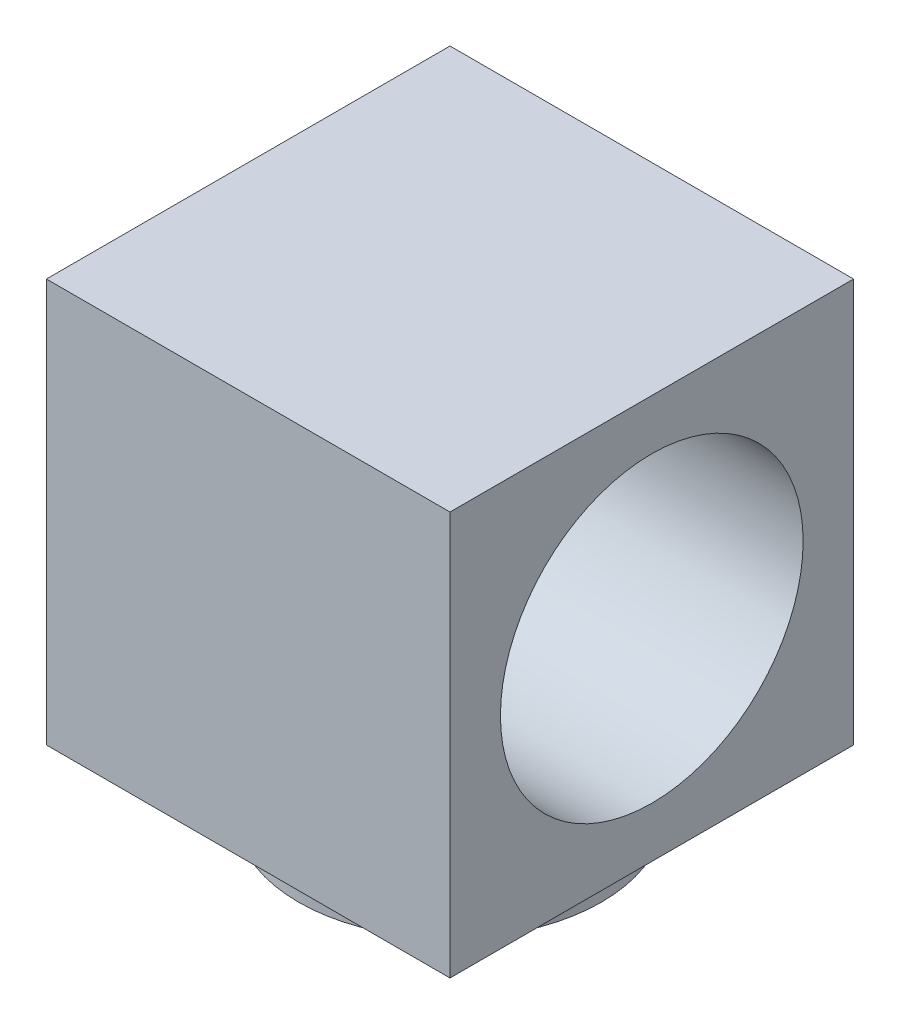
ISO-10303-21;
HEADER;
FILE_DESCRIPTION(('STEP AP214'),'2;1');
FILE_NAME('part.step','',(''),(''),'','','');
FILE_SCHEMA(('AUTOMOTIVE_DESIGN { 1 0 10303 214 1 1 1 1 }'));
ENDSEC;
DATA;
#1=APPLICATION_CONTEXT('core data for automotive mechanical design processes');
#2=APPLICATION_PROTOCOL_DEFINITION('international standard','automotive_design',2000,#1);
#3=PRODUCT_CONTEXT('',#1,'mechanical');
#4=PRODUCT('Part','Part','',(#3));
#5=PRODUCT_RELATED_PRODUCT_CATEGORY('part','',(#4));
#6=PRODUCT_DEFINITION_FORMATION('','',#4);
#7=PRODUCT_DEFINITION_CONTEXT('part definition',#1,'design');
#8=PRODUCT_DEFINITION('design','',#6,#7);
#9=PRODUCT_DEFINITION_SHAPE('','',#8);
#10=(LENGTH_UNIT() NAMED_UNIT(*) SI_UNIT(.MILLI.,.METRE.));
#11=(NAMED_UNIT(*) PLANE_ANGLE_UNIT() SI_UNIT($,.RADIAN.));
#12=(NAMED_UNIT(*) SI_UNIT($,.STERADIAN.) SOLID_ANGLE_UNIT());
#13=UNCERTAINTY_MEASURE_WITH_UNIT(LENGTH_MEASURE(1.E-05),#10,'distance_accuracy_value','');
#14=(GEOMETRIC_REPRESENTATION_CONTEXT(3) GLOBAL_UNCERTAINTY_ASSIGNED_CONTEXT((#13)) GLOBAL_UNIT_ASSIGNED_CONTEXT((#10,
#11,#12)) REPRESENTATION_CONTEXT('',''));
#15=CARTESIAN_POINT('',(0.,0.,0.));
#16=DIRECTION('',(0.,0.,1.));
#17=DIRECTION('',(1.,0.,0.));
#18=AXIS2_PLACEMENT_3D('',#15,#16,#17);
#19=CARTESIAN_POINT('',(-30.9040643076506,-178.652584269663,200.));
#20=DIRECTION('',(1.,0.,0.));
#21=DIRECTION('',(0.,0.,-1.));
#22=AXIS2_PLACEMENT_3D('',#19,#20,#21);
#23=PLANE('',#22);
#24=CARTESIAN_POINT('',(-30.9040643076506,-78.652584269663,100.));
#25=DIRECTION('',(1.,0.,0.));
#26=DIRECTION('',(0.,1.,0.));
#27=AXIS2_PLACEMENT_3D('',#24,#25,#26);
#28=CIRCLE('',#27,75.);
#29=CARTESIAN_POINT('',(-30.9040643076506,-3.65258426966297,100.));
#30=VERTEX_POINT('',#29);
#31=EDGE_CURVE('E108',#30,#30,#28,.T.);
#32=ORIENTED_EDGE('',*,*,#31,.T.);
#33=EDGE_LOOP('',(#32));
#34=FACE_BOUND('',#33,.T.);
#35=DIRECTION('',(0.,-1.,0.));
#36=VECTOR('',#35,1.);
#37=CARTESIAN_POINT('',(-30.9040643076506,-178.652584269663,0.));
#38=LINE('',#37,#36);
#39=CARTESIAN_POINT('',(-30.9040643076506,21.3474157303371,0.));
#40=VERTEX_POINT('',#39);
#41=CARTESIAN_POINT('',(-30.9040643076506,-178.652584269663,0.));
#42=VERTEX_POINT('',#41);
#43=EDGE_CURVE('E105',#40,#42,#38,.T.);
#44=ORIENTED_EDGE('',*,*,#43,.T.);
#45=DIRECTION('',(0.,0.,-1.));
#46=VECTOR('',#45,1.);
#47=CARTESIAN_POINT('',(-30.9040643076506,-178.652584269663,200.));
#48=LINE('',#47,#46);
#49=CARTESIAN_POINT('',(-30.9040643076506,-178.652584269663,200.));
#50=VERTEX_POINT('',#49);
#51=EDGE_CURVE('E47',#50,#42,#48,.T.);
#52=ORIENTED_EDGE('',*,*,#51,.F.);
#53=DIRECTION('',(0.,-1.,0.));
#54=VECTOR('',#53,1.);
#55=CARTESIAN_POINT('',(-30.9040643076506,-178.652584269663,200.));
#56=LINE('',#55,#54);
#57=CARTESIAN_POINT('',(-30.9040643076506,21.3474157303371,200.));
#58=VERTEX_POINT('',#57);
#59=EDGE_CURVE('E91',#58,#50,#56,.T.);
#60=ORIENTED_EDGE('',*,*,#59,.F.);
#61=DIRECTION('',(0.,0.,-1.));
#62=VECTOR('',#61,1.);
#63=CARTESIAN_POINT('',(-30.9040643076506,21.3474157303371,200.));
#64=LINE('',#63,#62);
#65=EDGE_CURVE('E101',#58,#40,#64,.T.);
#66=ORIENTED_EDGE('',*,*,#65,.T.);
#67=EDGE_LOOP('',(#44,#52,#60,#66));
#68=FACE_BOUND('',#67,.T.);
#69=ADVANCED_FACE('F39',(#34,#68),#23,.F.);
#70=CARTESIAN_POINT('',(169.095935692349,-178.652584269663,200.));
#71=DIRECTION('',(0.,1.,0.));
#72=DIRECTION('',(0.,0.,1.));
#73=AXIS2_PLACEMENT_3D('',#70,#71,#72);
#74=PLANE('',#73);
#75=CARTESIAN_POINT('',(69.0959356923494,-178.652584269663,100.));
#76=DIRECTION('',(0.,1.,0.));
#77=DIRECTION('',(0.,0.,1.));
#78=AXIS2_PLACEMENT_3D('',#75,#76,#77);
#79=CIRCLE('',#78,75.);
#80=CARTESIAN_POINT('',(69.0959356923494,-178.652584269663,175.));
#81=VERTEX_POINT('',#80);
#82=EDGE_CURVE('E11',#81,#81,#79,.F.);
#83=ORIENTED_EDGE('',*,*,#82,.F.);
#84=EDGE_LOOP('',(#83));
#85=FACE_BOUND('',#84,.T.);
#86=DIRECTION('',(1.,0.,0.));
#87=VECTOR('',#86,1.);
#88=CARTESIAN_POINT('',(169.095935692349,-178.652584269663,0.));
#89=LINE('',#88,#87);
#90=CARTESIAN_POINT('',(169.095935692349,-178.652584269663,0.));
#91=VERTEX_POINT('',#90);
#92=EDGE_CURVE('E96',#42,#91,#89,.T.);
#93=ORIENTED_EDGE('',*,*,#92,.T.);
#94=DIRECTION('',(0.,0.,-1.));
#95=VECTOR('',#94,1.);
#96=CARTESIAN_POINT('',(169.095935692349,-178.652584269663,200.));
#97=LINE('',#96,#95);
#98=CARTESIAN_POINT('',(169.095935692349,-178.652584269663,200.));
#99=VERTEX_POINT('',#98);
#100=EDGE_CURVE('E94',#99,#91,#97,.T.);
#101=ORIENTED_EDGE('',*,*,#100,.F.);
#102=DIRECTION('',(1.,0.,0.));
#103=VECTOR('',#102,1.);
#104=CARTESIAN_POINT('',(169.095935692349,-178.652584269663,200.));
#105=LINE('',#104,#103);
#106=EDGE_CURVE('E86',#50,#99,#105,.T.);
#107=ORIENTED_EDGE('',*,*,#106,.F.);
#108=ORIENTED_EDGE('',*,*,#51,.T.);
#109=EDGE_LOOP('',(#93,#101,#107,#108));
#110=FACE_BOUND('',#109,.T.);
#111=ADVANCED_FACE('F95',(#85,#110),#74,.F.);
#112=CARTESIAN_POINT('',(169.095935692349,21.3474157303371,200.));
#113=DIRECTION('',(-1.,0.,0.));
#114=DIRECTION('',(0.,-1.,0.));
#115=AXIS2_PLACEMENT_3D('',#112,#113,#114);
#116=PLANE('',#115);
#117=CARTESIAN_POINT('',(169.095935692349,-78.6525842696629,100.));
#118=DIRECTION('',(1.,0.,0.));
#119=DIRECTION('',(0.,1.,0.));
#120=AXIS2_PLACEMENT_3D('',#117,#118,#119);
#121=CIRCLE('',#120,75.);
#122=CARTESIAN_POINT('',(169.095935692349,-3.65258426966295,100.));
#123=VERTEX_POINT('',#122);
#124=EDGE_CURVE('E140',#123,#123,#121,.T.);
#125=ORIENTED_EDGE('',*,*,#124,.F.);
#126=EDGE_LOOP('',(#125));
#127=FACE_BOUND('',#126,.T.);
#128=DIRECTION('',(0.,1.,0.));
#129=VECTOR('',#128,1.);
#130=CARTESIAN_POINT('',(169.095935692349,21.3474157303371,0.));
#131=LINE('',#130,#129);
#132=CARTESIAN_POINT('',(169.095935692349,21.3474157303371,0.));
#133=VERTEX_POINT('',#132);
#134=EDGE_CURVE('E72',#91,#133,#131,.T.);
#135=ORIENTED_EDGE('',*,*,#134,.T.);
#136=DIRECTION('',(0.,0.,-1.));
#137=VECTOR('',#136,1.);
#138=CARTESIAN_POINT('',(169.095935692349,21.3474157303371,200.));
#139=LINE('',#138,#137);
#140=CARTESIAN_POINT('',(169.095935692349,21.3474157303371,200.));
#141=VERTEX_POINT('',#140);
#142=EDGE_CURVE('E97',#141,#133,#139,.T.);
#143=ORIENTED_EDGE('',*,*,#142,.F.);
#144=DIRECTION('',(0.,1.,0.));
#145=VECTOR('',#144,1.);
#146=CARTESIAN_POINT('',(169.095935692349,21.3474157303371,200.));
#147=LINE('',#146,#145);
#148=EDGE_CURVE('E89',#99,#141,#147,.T.);
#149=ORIENTED_EDGE('',*,*,#148,.F.);
#150=ORIENTED_EDGE('',*,*,#100,.T.);
#151=EDGE_LOOP('',(#135,#143,#149,#150));
#152=FACE_BOUND('',#151,.T.);
#153=ADVANCED_FACE('F99',(#127,#152),#116,.F.);
#154=CARTESIAN_POINT('',(-30.9040643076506,21.3474157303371,200.));
#155=DIRECTION('',(0.,-1.,0.));
#156=DIRECTION('',(0.,0.,-1.));
#157=AXIS2_PLACEMENT_3D('',#154,#155,#156);
#158=PLANE('',#157);
#159=DIRECTION('',(-1.,0.,0.));
#160=VECTOR('',#159,1.);
#161=CARTESIAN_POINT('',(-30.9040643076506,21.3474157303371,0.));
#162=LINE('',#161,#160);
#163=EDGE_CURVE('E78',#133,#40,#162,.T.);
#164=ORIENTED_EDGE('',*,*,#163,.T.);
#165=ORIENTED_EDGE('',*,*,#65,.F.);
#166=DIRECTION('',(-1.,0.,0.));
#167=VECTOR('',#166,1.);
#168=CARTESIAN_POINT('',(-30.9040643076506,21.3474157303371,200.));
#169=LINE('',#168,#167);
#170=EDGE_CURVE('E55',#141,#58,#169,.T.);
#171=ORIENTED_EDGE('',*,*,#170,.F.);
#172=ORIENTED_EDGE('',*,*,#142,.T.);
#173=EDGE_LOOP('',(#164,#165,#171,#172));
#174=FACE_BOUND('',#173,.T.);
#175=ADVANCED_FACE('F128',(#174),#158,.F.);
#176=CARTESIAN_POINT('',(0.,0.,200.));
#177=DIRECTION('',(0.,0.,-1.));
#178=DIRECTION('',(-1.,0.,0.));
#179=AXIS2_PLACEMENT_3D('',#176,#177,#178);
#180=PLANE('',#179);
#181=ORIENTED_EDGE('',*,*,#59,.T.);
#182=ORIENTED_EDGE('',*,*,#106,.T.);
#183=ORIENTED_EDGE('',*,*,#148,.T.);
#184=ORIENTED_EDGE('',*,*,#170,.T.);
#185=EDGE_LOOP('',(#181,#182,#183,#184));
#186=FACE_BOUND('',#185,.T.);
#187=ADVANCED_FACE('F87',(#186),#180,.F.);
#188=CARTESIAN_POINT('',(0.,0.,0.));
#189=DIRECTION('',(0.,0.,-1.));
#190=DIRECTION('',(-1.,0.,0.));
#191=AXIS2_PLACEMENT_3D('',#188,#189,#190);
#192=PLANE('',#191);
#193=ORIENTED_EDGE('',*,*,#43,.F.);
#194=ORIENTED_EDGE('',*,*,#163,.F.);
#195=ORIENTED_EDGE('',*,*,#134,.F.);
#196=ORIENTED_EDGE('',*,*,#92,.F.);
#197=EDGE_LOOP('',(#193,#194,#195,#196));
#198=FACE_BOUND('',#197,.T.);
#199=ADVANCED_FACE('F116',(#198),#192,.T.);
#200=CARTESIAN_POINT('',(-30.9040643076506,-78.652584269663,100.));
#201=DIRECTION('',(1.,0.,0.));
#202=DIRECTION('',(0.,1.,0.));
#203=AXIS2_PLACEMENT_3D('',#200,#201,#202);
#204=CYLINDRICAL_SURFACE('',#203,75.);
#205=ORIENTED_EDGE('',*,*,#31,.F.);
#206=EDGE_LOOP('',(#205));
#207=FACE_BOUND('',#206,.T.);
#208=ORIENTED_EDGE('',*,*,#124,.T.);
#209=EDGE_LOOP('',(#208));
#210=FACE_BOUND('',#209,.T.);
#211=ADVANCED_FACE('F118',(#207,#210),#204,.F.);
#212=CARTESIAN_POINT('',(69.0959356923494,-208.652584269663,100.));
#213=DIRECTION('',(0.,-1.,0.));
#214=DIRECTION('',(0.,0.,-1.));
#215=AXIS2_PLACEMENT_3D('',#212,#213,#214);
#216=PLANE('',#215);
#217=CARTESIAN_POINT('',(69.0959356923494,-208.652584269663,100.));
#218=DIRECTION('',(0.,-1.,0.));
#219=DIRECTION('',(0.,0.,-1.));
#220=AXIS2_PLACEMENT_3D('',#217,#218,#219);
#221=CIRCLE('',#220,75.);
#222=CARTESIAN_POINT('',(69.0959356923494,-208.652584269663,25.));
#223=VERTEX_POINT('',#222);
#224=EDGE_CURVE('E143',#223,#223,#221,.T.);
#225=ORIENTED_EDGE('',*,*,#224,.T.);
#226=EDGE_LOOP('',(#225));
#227=FACE_BOUND('',#226,.T.);
#228=CARTESIAN_POINT('',(69.0959356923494,-208.652584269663,100.));
#229=DIRECTION('',(0.,-1.,0.));
#230=DIRECTION('',(0.,0.,-1.));
#231=AXIS2_PLACEMENT_3D('',#228,#229,#230);
#232=CIRCLE('',#231,65.);
#233=CARTESIAN_POINT('',(69.0959356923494,-208.652584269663,35.));
#234=VERTEX_POINT('',#233);
#235=EDGE_CURVE('E148',#234,#234,#232,.T.);
#236=ORIENTED_EDGE('',*,*,#235,.F.);
#237=EDGE_LOOP('',(#236));
#238=FACE_BOUND('',#237,.T.);
#239=ADVANCED_FACE('F125',(#227,#238),#216,.T.);
#240=CARTESIAN_POINT('',(69.0959356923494,-208.652584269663,100.));
#241=DIRECTION('',(0.,1.,0.));
#242=DIRECTION('',(0.,0.,1.));
#243=AXIS2_PLACEMENT_3D('',#240,#241,#242);
#244=CYLINDRICAL_SURFACE('',#243,75.);
#245=ORIENTED_EDGE('',*,*,#224,.F.);
#246=EDGE_LOOP('',(#245));
#247=FACE_BOUND('',#246,.T.);
#248=ORIENTED_EDGE('',*,*,#82,.T.);
#249=EDGE_LOOP('',(#248));
#250=FACE_BOUND('',#249,.T.);
#251=ADVANCED_FACE('F159',(#247,#250),#244,.T.);
#252=CARTESIAN_POINT('',(69.0959356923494,-208.652584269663,100.));
#253=DIRECTION('',(0.,1.,0.));
#254=DIRECTION('',(0.,0.,1.));
#255=AXIS2_PLACEMENT_3D('',#252,#253,#254);
#256=CYLINDRICAL_SURFACE('',#255,65.);
#257=ORIENTED_EDGE('',*,*,#235,.T.);
#258=EDGE_LOOP('',(#257));
#259=FACE_BOUND('',#258,.T.);
#260=CARTESIAN_POINT('',(69.0959356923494,-178.652584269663,100.));
#261=DIRECTION('',(0.,-1.,0.));
#262=DIRECTION('',(0.,0.,-1.));
#263=AXIS2_PLACEMENT_3D('',#260,#261,#262);
#264=CIRCLE('',#263,65.);
#265=CARTESIAN_POINT('',(69.0959356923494,-178.652584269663,35.));
#266=VERTEX_POINT('',#265);
#267=EDGE_CURVE('E149',#266,#266,#264,.T.);
#268=ORIENTED_EDGE('',*,*,#267,.F.);
#269=EDGE_LOOP('',(#268));
#270=FACE_BOUND('',#269,.T.);
#271=ADVANCED_FACE('F155',(#259,#270),#256,.F.);
#272=ORIENTED_EDGE('',*,*,#267,.T.);
#273=EDGE_LOOP('',(#272));
#274=FACE_BOUND('',#273,.T.);
#275=ADVANCED_FACE('F137',(#274),#74,.F.);
#276=CLOSED_SHELL('',(#69,#111,#153,#175,#187,#199,#211,#239,#251,#271,#275));
#277=MANIFOLD_SOLID_BREP('B2',#276);
#278=ADVANCED_BREP_SHAPE_REPRESENTATION('',(#18,#277),#14);
#279=SHAPE_DEFINITION_REPRESENTATION(#9,#278);
ENDSEC;
END-ISO-10303-21;
